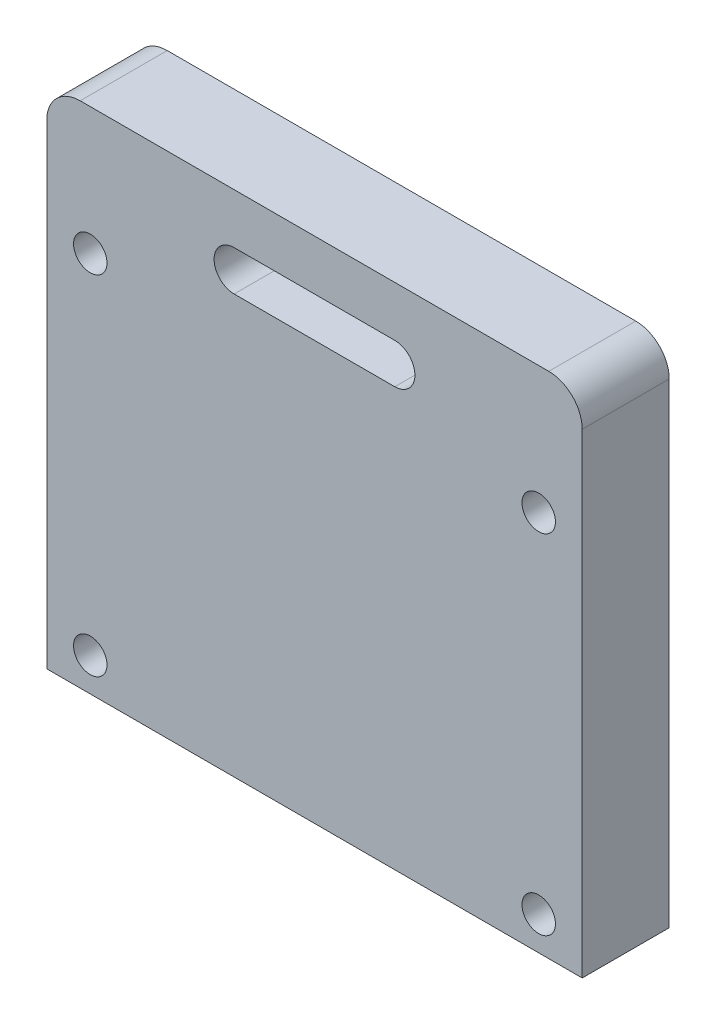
ISO-10303-21;
HEADER;
FILE_DESCRIPTION(('STEP AP214'),'2;1');
FILE_NAME('part.step','',(''),(''),'','','');
FILE_SCHEMA(('AUTOMOTIVE_DESIGN { 1 0 10303 214 1 1 1 1 }'));
ENDSEC;
DATA;
#1=APPLICATION_CONTEXT('core data for automotive mechanical design processes');
#2=APPLICATION_PROTOCOL_DEFINITION('international standard','automotive_design',2000,#1);
#3=PRODUCT_CONTEXT('',#1,'mechanical');
#4=PRODUCT('Part','Part','',(#3));
#5=PRODUCT_RELATED_PRODUCT_CATEGORY('part','',(#4));
#6=PRODUCT_DEFINITION_FORMATION('','',#4);
#7=PRODUCT_DEFINITION_CONTEXT('part definition',#1,'design');
#8=PRODUCT_DEFINITION('design','',#6,#7);
#9=PRODUCT_DEFINITION_SHAPE('','',#8);
#10=(LENGTH_UNIT() NAMED_UNIT(*) SI_UNIT(.MILLI.,.METRE.));
#11=(NAMED_UNIT(*) PLANE_ANGLE_UNIT() SI_UNIT($,.RADIAN.));
#12=(NAMED_UNIT(*) SI_UNIT($,.STERADIAN.) SOLID_ANGLE_UNIT());
#13=UNCERTAINTY_MEASURE_WITH_UNIT(LENGTH_MEASURE(1.E-05),#10,'distance_accuracy_value','');
#14=(GEOMETRIC_REPRESENTATION_CONTEXT(3) GLOBAL_UNCERTAINTY_ASSIGNED_CONTEXT((#13)) GLOBAL_UNIT_ASSIGNED_CONTEXT((#10,
#11,#12)) REPRESENTATION_CONTEXT('',''));
#15=CARTESIAN_POINT('',(0.,0.,0.));
#16=DIRECTION('',(0.,0.,1.));
#17=DIRECTION('',(1.,0.,0.));
#18=AXIS2_PLACEMENT_3D('',#15,#16,#17);
#19=CARTESIAN_POINT('',(-40.,0.,0.));
#20=DIRECTION('',(0.,0.,-1.));
#21=DIRECTION('',(-1.,0.,0.));
#22=AXIS2_PLACEMENT_3D('',#19,#20,#21);
#23=PLANE('',#22);
#24=CARTESIAN_POINT('',(-33.5,57.,0.));
#25=DIRECTION('',(0.,0.,1.));
#26=DIRECTION('',(1.,0.,0.));
#27=AXIS2_PLACEMENT_3D('',#24,#25,#26);
#28=CIRCLE('',#27,2.5);
#29=CARTESIAN_POINT('',(-31.,57.,0.));
#30=VERTEX_POINT('',#29);
#31=EDGE_CURVE('E347',#30,#30,#28,.T.);
#32=ORIENTED_EDGE('',*,*,#31,.T.);
#33=EDGE_LOOP('',(#32));
#34=FACE_BOUND('',#33,.T.);
#35=CARTESIAN_POINT('',(-33.5,5.,0.));
#36=DIRECTION('',(0.,0.,1.));
#37=DIRECTION('',(1.,0.,0.));
#38=AXIS2_PLACEMENT_3D('',#35,#36,#37);
#39=CIRCLE('',#38,2.5);
#40=CARTESIAN_POINT('',(-31.,5.,0.));
#41=VERTEX_POINT('',#40);
#42=EDGE_CURVE('E351',#41,#41,#39,.T.);
#43=ORIENTED_EDGE('',*,*,#42,.T.);
#44=EDGE_LOOP('',(#43));
#45=FACE_BOUND('',#44,.T.);
#46=CARTESIAN_POINT('',(33.5,5.,0.));
#47=DIRECTION('',(0.,0.,1.));
#48=DIRECTION('',(1.,0.,0.));
#49=AXIS2_PLACEMENT_3D('',#46,#47,#48);
#50=CIRCLE('',#49,2.5);
#51=CARTESIAN_POINT('',(36.,5.,0.));
#52=VERTEX_POINT('',#51);
#53=EDGE_CURVE('E360',#52,#52,#50,.T.);
#54=ORIENTED_EDGE('',*,*,#53,.T.);
#55=EDGE_LOOP('',(#54));
#56=FACE_BOUND('',#55,.T.);
#57=DIRECTION('',(-1.,0.,0.));
#58=VECTOR('',#57,1.);
#59=CARTESIAN_POINT('',(-40.,76.,0.));
#60=LINE('',#59,#58);
#61=CARTESIAN_POINT('',(35.,76.,0.));
#62=VERTEX_POINT('',#61);
#63=CARTESIAN_POINT('',(-35.,76.,0.));
#64=VERTEX_POINT('',#63);
#65=EDGE_CURVE('E152',#62,#64,#60,.T.);
#66=ORIENTED_EDGE('',*,*,#65,.F.);
#67=CARTESIAN_POINT('',(35.,71.,0.));
#68=DIRECTION('',(0.,0.,-1.));
#69=DIRECTION('',(-1.,0.,0.));
#70=AXIS2_PLACEMENT_3D('',#67,#68,#69);
#71=CIRCLE('',#70,5.);
#72=CARTESIAN_POINT('',(40.,71.,0.));
#73=VERTEX_POINT('',#72);
#74=EDGE_CURVE('E181',#62,#73,#71,.T.);
#75=ORIENTED_EDGE('',*,*,#74,.T.);
#76=DIRECTION('',(0.,1.,0.));
#77=VECTOR('',#76,1.);
#78=CARTESIAN_POINT('',(40.,0.,0.));
#79=LINE('',#78,#77);
#80=CARTESIAN_POINT('',(40.,0.,0.));
#81=VERTEX_POINT('',#80);
#82=EDGE_CURVE('E164',#81,#73,#79,.T.);
#83=ORIENTED_EDGE('',*,*,#82,.F.);
#84=DIRECTION('',(1.,0.,0.));
#85=VECTOR('',#84,1.);
#86=CARTESIAN_POINT('',(-40.,0.,0.));
#87=LINE('',#86,#85);
#88=CARTESIAN_POINT('',(-40.,0.,0.));
#89=VERTEX_POINT('',#88);
#90=EDGE_CURVE('E162',#89,#81,#87,.T.);
#91=ORIENTED_EDGE('',*,*,#90,.F.);
#92=DIRECTION('',(0.,-1.,0.));
#93=VECTOR('',#92,1.);
#94=CARTESIAN_POINT('',(-40.,0.,0.));
#95=LINE('',#94,#93);
#96=CARTESIAN_POINT('',(-40.,71.,0.));
#97=VERTEX_POINT('',#96);
#98=EDGE_CURVE('E145',#97,#89,#95,.T.);
#99=ORIENTED_EDGE('',*,*,#98,.F.);
#100=CARTESIAN_POINT('',(-35.,71.,0.));
#101=DIRECTION('',(0.,0.,-1.));
#102=DIRECTION('',(-1.,0.,0.));
#103=AXIS2_PLACEMENT_3D('',#100,#101,#102);
#104=CIRCLE('',#103,5.);
#105=EDGE_CURVE('E179',#97,#64,#104,.T.);
#106=ORIENTED_EDGE('',*,*,#105,.T.);
#107=EDGE_LOOP('',(#66,#75,#83,#91,#99,#106));
#108=FACE_BOUND('',#107,.T.);
#109=CARTESIAN_POINT('',(-12.,65.5,0.));
#110=DIRECTION('',(0.,0.,1.));
#111=DIRECTION('',(-1.,0.,0.));
#112=AXIS2_PLACEMENT_3D('',#109,#110,#111);
#113=CIRCLE('',#112,3.);
#114=CARTESIAN_POINT('',(-12.,68.5,0.));
#115=VERTEX_POINT('',#114);
#116=CARTESIAN_POINT('',(-12.,62.5,0.));
#117=VERTEX_POINT('',#116);
#118=EDGE_CURVE('E112',#115,#117,#113,.T.);
#119=ORIENTED_EDGE('',*,*,#118,.T.);
#120=DIRECTION('',(1.,0.,0.));
#121=VECTOR('',#120,1.);
#122=CARTESIAN_POINT('',(-12.,62.5,0.));
#123=LINE('',#122,#121);
#124=CARTESIAN_POINT('',(12.,62.5,0.));
#125=VERTEX_POINT('',#124);
#126=EDGE_CURVE('E121',#117,#125,#123,.T.);
#127=ORIENTED_EDGE('',*,*,#126,.T.);
#128=CARTESIAN_POINT('',(12.,65.5,0.));
#129=DIRECTION('',(0.,0.,1.));
#130=DIRECTION('',(1.,0.,0.));
#131=AXIS2_PLACEMENT_3D('',#128,#129,#130);
#132=CIRCLE('',#131,3.);
#133=CARTESIAN_POINT('',(12.,68.5,0.));
#134=VERTEX_POINT('',#133);
#135=EDGE_CURVE('E56',#125,#134,#132,.T.);
#136=ORIENTED_EDGE('',*,*,#135,.T.);
#137=DIRECTION('',(-1.,0.,0.));
#138=VECTOR('',#137,1.);
#139=CARTESIAN_POINT('',(-12.,68.5,0.));
#140=LINE('',#139,#138);
#141=EDGE_CURVE('E118',#134,#115,#140,.T.);
#142=ORIENTED_EDGE('',*,*,#141,.T.);
#143=EDGE_LOOP('',(#119,#127,#136,#142));
#144=FACE_BOUND('',#143,.T.);
#145=CARTESIAN_POINT('',(33.5,57.,0.));
#146=DIRECTION('',(0.,0.,1.));
#147=DIRECTION('',(1.,0.,0.));
#148=AXIS2_PLACEMENT_3D('',#145,#146,#147);
#149=CIRCLE('',#148,2.5);
#150=CARTESIAN_POINT('',(36.,57.,0.));
#151=VERTEX_POINT('',#150);
#152=EDGE_CURVE('E365',#151,#151,#149,.T.);
#153=ORIENTED_EDGE('',*,*,#152,.T.);
#154=EDGE_LOOP('',(#153));
#155=FACE_BOUND('',#154,.T.);
#156=ADVANCED_FACE('F33',(#34,#45,#56,#108,#144,#155),#23,.T.);
#157=CARTESIAN_POINT('',(-40.,0.,13.));
#158=DIRECTION('',(1.,0.,0.));
#159=DIRECTION('',(0.,0.,-1.));
#160=AXIS2_PLACEMENT_3D('',#157,#158,#159);
#161=PLANE('',#160);
#162=DIRECTION('',(0.,-1.,0.));
#163=VECTOR('',#162,1.);
#164=CARTESIAN_POINT('',(-40.,0.,13.));
#165=LINE('',#164,#163);
#166=CARTESIAN_POINT('',(-40.,71.,13.));
#167=VERTEX_POINT('',#166);
#168=CARTESIAN_POINT('',(-40.,0.,13.));
#169=VERTEX_POINT('',#168);
#170=EDGE_CURVE('E149',#167,#169,#165,.T.);
#171=ORIENTED_EDGE('',*,*,#170,.F.);
#172=DIRECTION('',(0.,0.,-1.));
#173=VECTOR('',#172,1.);
#174=CARTESIAN_POINT('',(-40.,71.,13.));
#175=LINE('',#174,#173);
#176=EDGE_CURVE('E11',#167,#97,#175,.T.);
#177=ORIENTED_EDGE('',*,*,#176,.T.);
#178=ORIENTED_EDGE('',*,*,#98,.T.);
#179=DIRECTION('',(0.,0.,-1.));
#180=VECTOR('',#179,1.);
#181=CARTESIAN_POINT('',(-40.,0.,13.));
#182=LINE('',#181,#180);
#183=EDGE_CURVE('E171',#169,#89,#182,.T.);
#184=ORIENTED_EDGE('',*,*,#183,.F.);
#185=EDGE_LOOP('',(#171,#177,#178,#184));
#186=FACE_BOUND('',#185,.T.);
#187=ADVANCED_FACE('F213',(#186),#161,.F.);
#188=CARTESIAN_POINT('',(-40.,0.,13.));
#189=DIRECTION('',(0.,1.,0.));
#190=DIRECTION('',(0.,0.,1.));
#191=AXIS2_PLACEMENT_3D('',#188,#189,#190);
#192=PLANE('',#191);
#193=ORIENTED_EDGE('',*,*,#90,.T.);
#194=DIRECTION('',(0.,0.,-1.));
#195=VECTOR('',#194,1.);
#196=CARTESIAN_POINT('',(40.,0.,13.));
#197=LINE('',#196,#195);
#198=CARTESIAN_POINT('',(40.,0.,13.));
#199=VERTEX_POINT('',#198);
#200=EDGE_CURVE('E160',#199,#81,#197,.T.);
#201=ORIENTED_EDGE('',*,*,#200,.F.);
#202=DIRECTION('',(1.,0.,0.));
#203=VECTOR('',#202,1.);
#204=CARTESIAN_POINT('',(-40.,0.,13.));
#205=LINE('',#204,#203);
#206=EDGE_CURVE('E151',#169,#199,#205,.T.);
#207=ORIENTED_EDGE('',*,*,#206,.F.);
#208=ORIENTED_EDGE('',*,*,#183,.T.);
#209=EDGE_LOOP('',(#193,#201,#207,#208));
#210=FACE_BOUND('',#209,.T.);
#211=ADVANCED_FACE('F208',(#210),#192,.F.);
#212=CARTESIAN_POINT('',(40.,0.,13.));
#213=DIRECTION('',(-1.,0.,0.));
#214=DIRECTION('',(0.,0.,1.));
#215=AXIS2_PLACEMENT_3D('',#212,#213,#214);
#216=PLANE('',#215);
#217=ORIENTED_EDGE('',*,*,#82,.T.);
#218=DIRECTION('',(0.,0.,-1.));
#219=VECTOR('',#218,1.);
#220=CARTESIAN_POINT('',(40.,71.,13.));
#221=LINE('',#220,#219);
#222=CARTESIAN_POINT('',(40.,71.,13.));
#223=VERTEX_POINT('',#222);
#224=EDGE_CURVE('E183',#73,#223,#221,.F.);
#225=ORIENTED_EDGE('',*,*,#224,.T.);
#226=DIRECTION('',(0.,1.,0.));
#227=VECTOR('',#226,1.);
#228=CARTESIAN_POINT('',(40.,0.,13.));
#229=LINE('',#228,#227);
#230=EDGE_CURVE('E154',#199,#223,#229,.T.);
#231=ORIENTED_EDGE('',*,*,#230,.F.);
#232=ORIENTED_EDGE('',*,*,#200,.T.);
#233=EDGE_LOOP('',(#217,#225,#231,#232));
#234=FACE_BOUND('',#233,.T.);
#235=ADVANCED_FACE('F204',(#234),#216,.F.);
#236=CARTESIAN_POINT('',(-40.,76.,13.));
#237=DIRECTION('',(0.,-1.,0.));
#238=DIRECTION('',(1.,0.,0.));
#239=AXIS2_PLACEMENT_3D('',#236,#237,#238);
#240=PLANE('',#239);
#241=DIRECTION('',(-1.,0.,0.));
#242=VECTOR('',#241,1.);
#243=CARTESIAN_POINT('',(-40.,76.,13.));
#244=LINE('',#243,#242);
#245=CARTESIAN_POINT('',(35.,76.,13.));
#246=VERTEX_POINT('',#245);
#247=CARTESIAN_POINT('',(-35.,76.,13.));
#248=VERTEX_POINT('',#247);
#249=EDGE_CURVE('E157',#246,#248,#244,.T.);
#250=ORIENTED_EDGE('',*,*,#249,.F.);
#251=DIRECTION('',(0.,0.,-1.));
#252=VECTOR('',#251,1.);
#253=CARTESIAN_POINT('',(35.,76.,13.));
#254=LINE('',#253,#252);
#255=EDGE_CURVE('E176',#246,#62,#254,.T.);
#256=ORIENTED_EDGE('',*,*,#255,.T.);
#257=ORIENTED_EDGE('',*,*,#65,.T.);
#258=DIRECTION('',(0.,0.,-1.));
#259=VECTOR('',#258,1.);
#260=CARTESIAN_POINT('',(-35.,76.,13.));
#261=LINE('',#260,#259);
#262=EDGE_CURVE('E174',#64,#248,#261,.F.);
#263=ORIENTED_EDGE('',*,*,#262,.T.);
#264=EDGE_LOOP('',(#250,#256,#257,#263));
#265=FACE_BOUND('',#264,.T.);
#266=ADVANCED_FACE('F196',(#265),#240,.F.);
#267=CARTESIAN_POINT('',(-40.,0.,13.));
#268=DIRECTION('',(0.,0.,-1.));
#269=DIRECTION('',(-1.,0.,0.));
#270=AXIS2_PLACEMENT_3D('',#267,#268,#269);
#271=PLANE('',#270);
#272=CARTESIAN_POINT('',(-33.5,57.,13.));
#273=DIRECTION('',(0.,0.,1.));
#274=DIRECTION('',(1.,0.,0.));
#275=AXIS2_PLACEMENT_3D('',#272,#273,#274);
#276=CIRCLE('',#275,2.49999999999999);
#277=CARTESIAN_POINT('',(-31.,57.,13.));
#278=VERTEX_POINT('',#277);
#279=EDGE_CURVE('E350',#278,#278,#276,.T.);
#280=ORIENTED_EDGE('',*,*,#279,.F.);
#281=EDGE_LOOP('',(#280));
#282=FACE_BOUND('',#281,.T.);
#283=CARTESIAN_POINT('',(-33.5,5.,13.));
#284=DIRECTION('',(0.,0.,1.));
#285=DIRECTION('',(1.,0.,0.));
#286=AXIS2_PLACEMENT_3D('',#283,#284,#285);
#287=CIRCLE('',#286,2.49999999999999);
#288=CARTESIAN_POINT('',(-31.,5.,13.));
#289=VERTEX_POINT('',#288);
#290=EDGE_CURVE('E354',#289,#289,#287,.T.);
#291=ORIENTED_EDGE('',*,*,#290,.F.);
#292=EDGE_LOOP('',(#291));
#293=FACE_BOUND('',#292,.T.);
#294=CARTESIAN_POINT('',(33.5,5.,13.));
#295=DIRECTION('',(0.,0.,1.));
#296=DIRECTION('',(1.,0.,0.));
#297=AXIS2_PLACEMENT_3D('',#294,#295,#296);
#298=CIRCLE('',#297,2.49999999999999);
#299=CARTESIAN_POINT('',(36.,5.,13.));
#300=VERTEX_POINT('',#299);
#301=EDGE_CURVE('E363',#300,#300,#298,.T.);
#302=ORIENTED_EDGE('',*,*,#301,.F.);
#303=EDGE_LOOP('',(#302));
#304=FACE_BOUND('',#303,.T.);
#305=CARTESIAN_POINT('',(33.5,57.,13.));
#306=DIRECTION('',(0.,0.,1.));
#307=DIRECTION('',(1.,0.,0.));
#308=AXIS2_PLACEMENT_3D('',#305,#306,#307);
#309=CIRCLE('',#308,2.49999999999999);
#310=CARTESIAN_POINT('',(36.,57.,13.));
#311=VERTEX_POINT('',#310);
#312=EDGE_CURVE('E133',#311,#311,#309,.T.);
#313=ORIENTED_EDGE('',*,*,#312,.F.);
#314=EDGE_LOOP('',(#313));
#315=FACE_BOUND('',#314,.T.);
#316=DIRECTION('',(1.,0.,0.));
#317=VECTOR('',#316,1.);
#318=CARTESIAN_POINT('',(-12.,62.5,13.));
#319=LINE('',#318,#317);
#320=CARTESIAN_POINT('',(-12.,62.5,13.));
#321=VERTEX_POINT('',#320);
#322=CARTESIAN_POINT('',(12.,62.5,13.));
#323=VERTEX_POINT('',#322);
#324=EDGE_CURVE('E139',#321,#323,#319,.T.);
#325=ORIENTED_EDGE('',*,*,#324,.F.);
#326=CARTESIAN_POINT('',(-12.,65.5,13.));
#327=DIRECTION('',(0.,0.,1.));
#328=DIRECTION('',(-1.,0.,0.));
#329=AXIS2_PLACEMENT_3D('',#326,#327,#328);
#330=CIRCLE('',#329,3.);
#331=CARTESIAN_POINT('',(-12.,68.5,13.));
#332=VERTEX_POINT('',#331);
#333=EDGE_CURVE('E48',#332,#321,#330,.T.);
#334=ORIENTED_EDGE('',*,*,#333,.F.);
#335=DIRECTION('',(-1.,0.,0.));
#336=VECTOR('',#335,1.);
#337=CARTESIAN_POINT('',(-12.,68.5,13.));
#338=LINE('',#337,#336);
#339=CARTESIAN_POINT('',(12.,68.5,13.));
#340=VERTEX_POINT('',#339);
#341=EDGE_CURVE('E127',#340,#332,#338,.T.);
#342=ORIENTED_EDGE('',*,*,#341,.F.);
#343=CARTESIAN_POINT('',(12.,65.5,13.));
#344=DIRECTION('',(0.,0.,1.));
#345=DIRECTION('',(1.,0.,0.));
#346=AXIS2_PLACEMENT_3D('',#343,#344,#345);
#347=CIRCLE('',#346,3.);
#348=EDGE_CURVE('E130',#323,#340,#347,.T.);
#349=ORIENTED_EDGE('',*,*,#348,.F.);
#350=EDGE_LOOP('',(#325,#334,#342,#349));
#351=FACE_BOUND('',#350,.T.);
#352=ORIENTED_EDGE('',*,*,#230,.T.);
#353=CARTESIAN_POINT('',(35.,71.,13.));
#354=DIRECTION('',(0.,0.,-1.));
#355=DIRECTION('',(-1.,0.,0.));
#356=AXIS2_PLACEMENT_3D('',#353,#354,#355);
#357=CIRCLE('',#356,5.);
#358=EDGE_CURVE('E41',#223,#246,#357,.F.);
#359=ORIENTED_EDGE('',*,*,#358,.T.);
#360=ORIENTED_EDGE('',*,*,#249,.T.);
#361=CARTESIAN_POINT('',(-35.,71.,13.));
#362=DIRECTION('',(0.,0.,-1.));
#363=DIRECTION('',(-1.,0.,0.));
#364=AXIS2_PLACEMENT_3D('',#361,#362,#363);
#365=CIRCLE('',#364,5.);
#366=EDGE_CURVE('E185',#248,#167,#365,.F.);
#367=ORIENTED_EDGE('',*,*,#366,.T.);
#368=ORIENTED_EDGE('',*,*,#170,.T.);
#369=ORIENTED_EDGE('',*,*,#206,.T.);
#370=EDGE_LOOP('',(#352,#359,#360,#367,#368,#369));
#371=FACE_BOUND('',#370,.T.);
#372=ADVANCED_FACE('F189',(#282,#293,#304,#315,#351,#371),#271,.F.);
#373=CARTESIAN_POINT('',(35.,71.,13.));
#374=DIRECTION('',(0.,0.,-1.));
#375=DIRECTION('',(-1.,0.,0.));
#376=AXIS2_PLACEMENT_3D('',#373,#374,#375);
#377=CYLINDRICAL_SURFACE('',#376,5.);
#378=ORIENTED_EDGE('',*,*,#358,.F.);
#379=ORIENTED_EDGE('',*,*,#224,.F.);
#380=ORIENTED_EDGE('',*,*,#74,.F.);
#381=ORIENTED_EDGE('',*,*,#255,.F.);
#382=EDGE_LOOP('',(#378,#379,#380,#381));
#383=FACE_BOUND('',#382,.T.);
#384=ADVANCED_FACE('F199',(#383),#377,.T.);
#385=CARTESIAN_POINT('',(-35.,71.,13.));
#386=DIRECTION('',(0.,0.,-1.));
#387=DIRECTION('',(-1.,0.,0.));
#388=AXIS2_PLACEMENT_3D('',#385,#386,#387);
#389=CYLINDRICAL_SURFACE('',#388,5.);
#390=ORIENTED_EDGE('',*,*,#366,.F.);
#391=ORIENTED_EDGE('',*,*,#262,.F.);
#392=ORIENTED_EDGE('',*,*,#105,.F.);
#393=ORIENTED_EDGE('',*,*,#176,.F.);
#394=EDGE_LOOP('',(#390,#391,#392,#393));
#395=FACE_BOUND('',#394,.T.);
#396=ADVANCED_FACE('F35',(#395),#389,.T.);
#397=CARTESIAN_POINT('',(-12.,65.5,0.));
#398=DIRECTION('',(0.,0.,1.));
#399=DIRECTION('',(1.,0.,0.));
#400=AXIS2_PLACEMENT_3D('',#397,#398,#399);
#401=CYLINDRICAL_SURFACE('',#400,3.);
#402=ORIENTED_EDGE('',*,*,#333,.T.);
#403=DIRECTION('',(0.,0.,1.));
#404=VECTOR('',#403,1.);
#405=CARTESIAN_POINT('',(-12.,62.5,0.));
#406=LINE('',#405,#404);
#407=EDGE_CURVE('E108',#117,#321,#406,.T.);
#408=ORIENTED_EDGE('',*,*,#407,.F.);
#409=ORIENTED_EDGE('',*,*,#118,.F.);
#410=DIRECTION('',(0.,0.,1.));
#411=VECTOR('',#410,1.);
#412=CARTESIAN_POINT('',(-12.,68.5,0.));
#413=LINE('',#412,#411);
#414=EDGE_CURVE('E143',#115,#332,#413,.T.);
#415=ORIENTED_EDGE('',*,*,#414,.T.);
#416=EDGE_LOOP('',(#402,#408,#409,#415));
#417=FACE_BOUND('',#416,.T.);
#418=ADVANCED_FACE('F110',(#417),#401,.F.);
#419=CARTESIAN_POINT('',(-12.,68.5,0.));
#420=DIRECTION('',(0.,1.,0.));
#421=DIRECTION('',(0.,0.,1.));
#422=AXIS2_PLACEMENT_3D('',#419,#420,#421);
#423=PLANE('',#422);
#424=ORIENTED_EDGE('',*,*,#341,.T.);
#425=ORIENTED_EDGE('',*,*,#414,.F.);
#426=ORIENTED_EDGE('',*,*,#141,.F.);
#427=DIRECTION('',(0.,0.,1.));
#428=VECTOR('',#427,1.);
#429=CARTESIAN_POINT('',(12.,68.5,0.));
#430=LINE('',#429,#428);
#431=EDGE_CURVE('E146',#134,#340,#430,.T.);
#432=ORIENTED_EDGE('',*,*,#431,.T.);
#433=EDGE_LOOP('',(#424,#425,#426,#432));
#434=FACE_BOUND('',#433,.T.);
#435=ADVANCED_FACE('F221',(#434),#423,.F.);
#436=CARTESIAN_POINT('',(12.,65.5,0.));
#437=DIRECTION('',(0.,0.,1.));
#438=DIRECTION('',(1.,0.,0.));
#439=AXIS2_PLACEMENT_3D('',#436,#437,#438);
#440=CYLINDRICAL_SURFACE('',#439,3.);
#441=ORIENTED_EDGE('',*,*,#348,.T.);
#442=ORIENTED_EDGE('',*,*,#431,.F.);
#443=ORIENTED_EDGE('',*,*,#135,.F.);
#444=DIRECTION('',(0.,0.,1.));
#445=VECTOR('',#444,1.);
#446=CARTESIAN_POINT('',(12.,62.5,0.));
#447=LINE('',#446,#445);
#448=EDGE_CURVE('E117',#125,#323,#447,.T.);
#449=ORIENTED_EDGE('',*,*,#448,.T.);
#450=EDGE_LOOP('',(#441,#442,#443,#449));
#451=FACE_BOUND('',#450,.T.);
#452=ADVANCED_FACE('F281',(#451),#440,.F.);
#453=CARTESIAN_POINT('',(-12.,62.5,0.));
#454=DIRECTION('',(0.,-1.,0.));
#455=DIRECTION('',(0.,0.,-1.));
#456=AXIS2_PLACEMENT_3D('',#453,#454,#455);
#457=PLANE('',#456);
#458=ORIENTED_EDGE('',*,*,#324,.T.);
#459=ORIENTED_EDGE('',*,*,#448,.F.);
#460=ORIENTED_EDGE('',*,*,#126,.F.);
#461=ORIENTED_EDGE('',*,*,#407,.T.);
#462=EDGE_LOOP('',(#458,#459,#460,#461));
#463=FACE_BOUND('',#462,.T.);
#464=ADVANCED_FACE('F122',(#463),#457,.F.);
#465=CARTESIAN_POINT('',(33.5,57.,13.));
#466=DIRECTION('',(0.,0.,1.));
#467=DIRECTION('',(1.,0.,0.));
#468=AXIS2_PLACEMENT_3D('',#465,#466,#467);
#469=CYLINDRICAL_SURFACE('',#468,2.49999999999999);
#470=ORIENTED_EDGE('',*,*,#152,.F.);
#471=EDGE_LOOP('',(#470));
#472=FACE_BOUND('',#471,.T.);
#473=ORIENTED_EDGE('',*,*,#312,.T.);
#474=EDGE_LOOP('',(#473));
#475=FACE_BOUND('',#474,.T.);
#476=ADVANCED_FACE('F298',(#472,#475),#469,.F.);
#477=CARTESIAN_POINT('',(33.5,5.,13.));
#478=DIRECTION('',(0.,0.,1.));
#479=DIRECTION('',(1.,0.,0.));
#480=AXIS2_PLACEMENT_3D('',#477,#478,#479);
#481=CYLINDRICAL_SURFACE('',#480,2.49999999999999);
#482=ORIENTED_EDGE('',*,*,#53,.F.);
#483=EDGE_LOOP('',(#482));
#484=FACE_BOUND('',#483,.T.);
#485=ORIENTED_EDGE('',*,*,#301,.T.);
#486=EDGE_LOOP('',(#485));
#487=FACE_BOUND('',#486,.T.);
#488=ADVANCED_FACE('F312',(#484,#487),#481,.F.);
#489=CARTESIAN_POINT('',(-33.5,5.,13.));
#490=DIRECTION('',(0.,0.,1.));
#491=DIRECTION('',(1.,0.,0.));
#492=AXIS2_PLACEMENT_3D('',#489,#490,#491);
#493=CYLINDRICAL_SURFACE('',#492,2.49999999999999);
#494=ORIENTED_EDGE('',*,*,#42,.F.);
#495=EDGE_LOOP('',(#494));
#496=FACE_BOUND('',#495,.T.);
#497=ORIENTED_EDGE('',*,*,#290,.T.);
#498=EDGE_LOOP('',(#497));
#499=FACE_BOUND('',#498,.T.);
#500=ADVANCED_FACE('F321',(#496,#499),#493,.F.);
#501=CARTESIAN_POINT('',(-33.5,57.,13.));
#502=DIRECTION('',(0.,0.,1.));
#503=DIRECTION('',(1.,0.,0.));
#504=AXIS2_PLACEMENT_3D('',#501,#502,#503);
#505=CYLINDRICAL_SURFACE('',#504,2.49999999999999);
#506=ORIENTED_EDGE('',*,*,#31,.F.);
#507=EDGE_LOOP('',(#506));
#508=FACE_BOUND('',#507,.T.);
#509=ORIENTED_EDGE('',*,*,#279,.T.);
#510=EDGE_LOOP('',(#509));
#511=FACE_BOUND('',#510,.T.);
#512=ADVANCED_FACE('F330',(#508,#511),#505,.F.);
#513=CLOSED_SHELL('',(#156,#187,#211,#235,#266,#372,#384,#396,#418,#435,#452,#464,#476,#488,
#500,#512));
#514=MANIFOLD_SOLID_BREP('B2',#513);
#515=ADVANCED_BREP_SHAPE_REPRESENTATION('',(#18,#514),#14);
#516=SHAPE_DEFINITION_REPRESENTATION(#9,#515);
ENDSEC;
END-ISO-10303-21;
